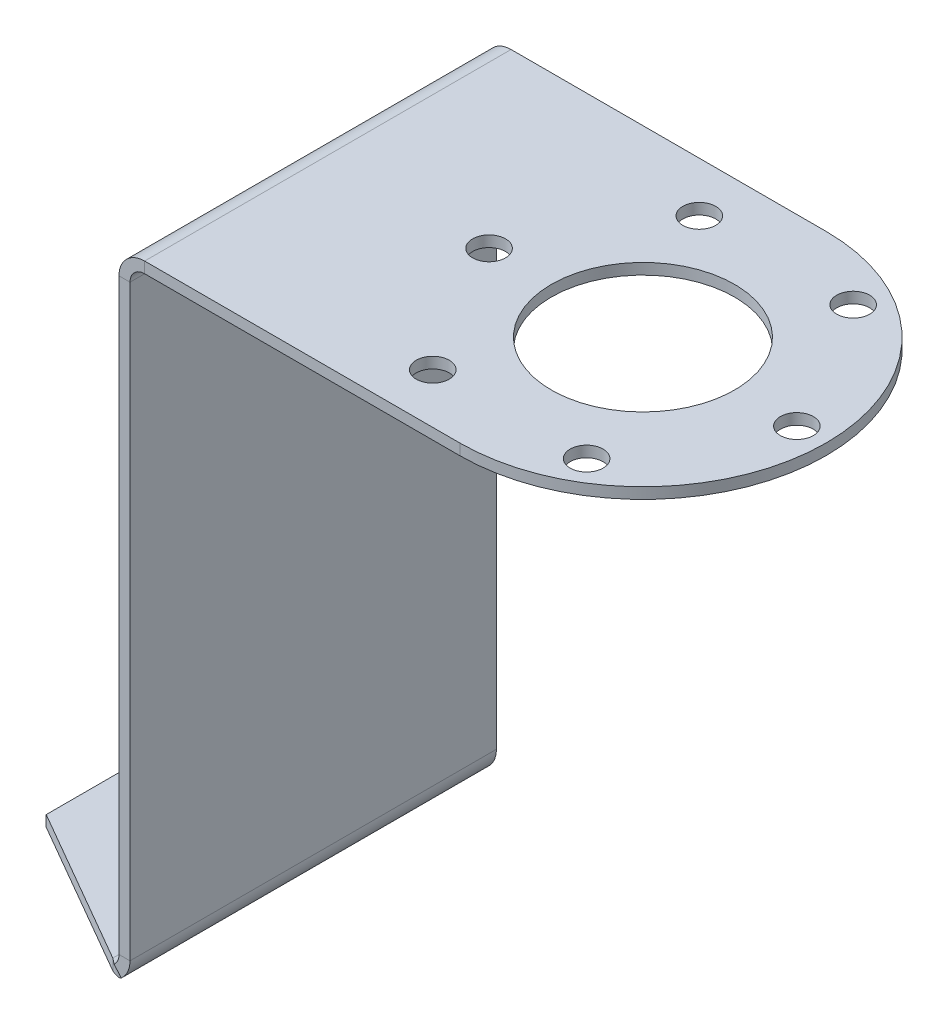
ISO-10303-21;
HEADER;
FILE_DESCRIPTION(('STEP AP214'),'2;1');
FILE_NAME('part.step','',(''),(''),'','','');
FILE_SCHEMA(('AUTOMOTIVE_DESIGN { 1 0 10303 214 1 1 1 1 }'));
ENDSEC;
DATA;
#1=APPLICATION_CONTEXT('core data for automotive mechanical design processes');
#2=APPLICATION_PROTOCOL_DEFINITION('international standard','automotive_design',2000,#1);
#3=PRODUCT_CONTEXT('',#1,'mechanical');
#4=PRODUCT('Part','Part','',(#3));
#5=PRODUCT_RELATED_PRODUCT_CATEGORY('part','',(#4));
#6=PRODUCT_DEFINITION_FORMATION('','',#4);
#7=PRODUCT_DEFINITION_CONTEXT('part definition',#1,'design');
#8=PRODUCT_DEFINITION('design','',#6,#7);
#9=PRODUCT_DEFINITION_SHAPE('','',#8);
#10=(LENGTH_UNIT() NAMED_UNIT(*) SI_UNIT(.MILLI.,.METRE.));
#11=(NAMED_UNIT(*) PLANE_ANGLE_UNIT() SI_UNIT($,.RADIAN.));
#12=(NAMED_UNIT(*) SI_UNIT($,.STERADIAN.) SOLID_ANGLE_UNIT());
#13=UNCERTAINTY_MEASURE_WITH_UNIT(LENGTH_MEASURE(1.E-05),#10,'distance_accuracy_value','');
#14=(GEOMETRIC_REPRESENTATION_CONTEXT(3) GLOBAL_UNCERTAINTY_ASSIGNED_CONTEXT((#13)) GLOBAL_UNIT_ASSIGNED_CONTEXT((#10,
#11,#12)) REPRESENTATION_CONTEXT('',''));
#15=CARTESIAN_POINT('',(0.,0.,0.));
#16=DIRECTION('',(0.,0.,1.));
#17=DIRECTION('',(1.,0.,0.));
#18=AXIS2_PLACEMENT_3D('',#15,#16,#17);
#19=CARTESIAN_POINT('',(-1.2490009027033E-13,0.,0.));
#20=DIRECTION('',(0.,1.,0.));
#21=DIRECTION('',(-1.,0.,0.));
#22=AXIS2_PLACEMENT_3D('',#19,#20,#21);
#23=CYLINDRICAL_SURFACE('',#22,12.5);
#24=CARTESIAN_POINT('',(-1.2490009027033E-13,0.,0.));
#25=DIRECTION('',(0.,1.,0.));
#26=DIRECTION('',(-1.,0.,0.));
#27=AXIS2_PLACEMENT_3D('',#24,#25,#26);
#28=CIRCLE('',#27,12.5);
#29=CARTESIAN_POINT('',(-12.5000000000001,0.,-1.13981649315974E-13));
#30=VERTEX_POINT('',#29);
#31=EDGE_CURVE('E479',#30,#30,#28,.T.);
#32=ORIENTED_EDGE('',*,*,#31,.F.);
#33=EDGE_LOOP('',(#32));
#34=FACE_BOUND('',#33,.T.);
#35=CARTESIAN_POINT('',(-1.2490009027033E-13,1.5000000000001,0.));
#36=DIRECTION('',(0.,1.,0.));
#37=DIRECTION('',(-1.,0.,0.));
#38=AXIS2_PLACEMENT_3D('',#35,#36,#37);
#39=CIRCLE('',#38,12.5);
#40=CARTESIAN_POINT('',(-12.5000000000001,1.5000000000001,-1.19810320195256E-13));
#41=VERTEX_POINT('',#40);
#42=EDGE_CURVE('E510',#41,#41,#39,.T.);
#43=ORIENTED_EDGE('',*,*,#42,.T.);
#44=EDGE_LOOP('',(#43));
#45=FACE_BOUND('',#44,.T.);
#46=ADVANCED_FACE('F28',(#34,#45),#23,.F.);
#47=CARTESIAN_POINT('',(-10.5000000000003,-85.7000000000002,18.1865334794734));
#48=DIRECTION('',(0.,1.,0.));
#49=DIRECTION('',(-1.,0.,0.));
#50=AXIS2_PLACEMENT_3D('',#47,#48,#49);
#51=CYLINDRICAL_SURFACE('',#50,2.25);
#52=CARTESIAN_POINT('',(-10.5000000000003,1.50000000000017,18.1865334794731));
#53=DIRECTION('',(0.,1.,0.));
#54=DIRECTION('',(-1.,0.,0.));
#55=AXIS2_PLACEMENT_3D('',#52,#53,#54);
#56=CIRCLE('',#55,2.25);
#57=CARTESIAN_POINT('',(-12.7500000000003,1.50000000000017,18.186533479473));
#58=VERTEX_POINT('',#57);
#59=EDGE_CURVE('E507',#58,#58,#56,.T.);
#60=ORIENTED_EDGE('',*,*,#59,.T.);
#61=EDGE_LOOP('',(#60));
#62=FACE_BOUND('',#61,.T.);
#63=CARTESIAN_POINT('',(-10.5000000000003,1.73472347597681E-13,18.1865334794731));
#64=DIRECTION('',(0.,1.,0.));
#65=DIRECTION('',(0.,0.,1.));
#66=AXIS2_PLACEMENT_3D('',#63,#64,#65);
#67=CIRCLE('',#66,2.25);
#68=CARTESIAN_POINT('',(-10.5000000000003,1.82215353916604E-13,20.4365334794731));
#69=VERTEX_POINT('',#68);
#70=EDGE_CURVE('E476',#69,#69,#67,.T.);
#71=ORIENTED_EDGE('',*,*,#70,.F.);
#72=EDGE_LOOP('',(#71));
#73=FACE_BOUND('',#72,.T.);
#74=ADVANCED_FACE('F650',(#62,#73),#51,.F.);
#75=CARTESIAN_POINT('',(10.4999999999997,-85.7000000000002,18.1865334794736));
#76=DIRECTION('',(0.,1.,0.));
#77=DIRECTION('',(-1.,0.,0.));
#78=AXIS2_PLACEMENT_3D('',#75,#76,#77);
#79=CYLINDRICAL_SURFACE('',#78,2.25);
#80=CARTESIAN_POINT('',(10.4999999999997,1.50000000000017,18.1865334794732));
#81=DIRECTION('',(0.,1.,0.));
#82=DIRECTION('',(-0.500000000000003,0.,0.866025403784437));
#83=AXIS2_PLACEMENT_3D('',#80,#81,#82);
#84=CIRCLE('',#83,2.25);
#85=CARTESIAN_POINT('',(9.37499999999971,1.50000000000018,20.1350906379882));
#86=VERTEX_POINT('',#85);
#87=EDGE_CURVE('E498',#86,#86,#84,.T.);
#88=ORIENTED_EDGE('',*,*,#87,.T.);
#89=EDGE_LOOP('',(#88));
#90=FACE_BOUND('',#89,.T.);
#91=CARTESIAN_POINT('',(10.4999999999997,1.73472347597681E-13,18.1865334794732));
#92=DIRECTION('',(0.,1.,0.));
#93=DIRECTION('',(0.,0.,1.));
#94=AXIS2_PLACEMENT_3D('',#91,#92,#93);
#95=CIRCLE('',#94,2.25);
#96=CARTESIAN_POINT('',(10.4999999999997,1.82215353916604E-13,20.4365334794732));
#97=VERTEX_POINT('',#96);
#98=EDGE_CURVE('E473',#97,#97,#95,.T.);
#99=ORIENTED_EDGE('',*,*,#98,.F.);
#100=EDGE_LOOP('',(#99));
#101=FACE_BOUND('',#100,.T.);
#102=ADVANCED_FACE('F646',(#90,#101),#79,.F.);
#103=CARTESIAN_POINT('',(20.9999999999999,-85.7000000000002,4.06726827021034E-13));
#104=DIRECTION('',(0.,1.,0.));
#105=DIRECTION('',(-1.,0.,0.));
#106=AXIS2_PLACEMENT_3D('',#103,#104,#105);
#107=CYLINDRICAL_SURFACE('',#106,2.25);
#108=CARTESIAN_POINT('',(20.9999999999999,1.50000000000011,0.));
#109=DIRECTION('',(0.,1.,0.));
#110=DIRECTION('',(0.499999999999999,0.,0.866025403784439));
#111=AXIS2_PLACEMENT_3D('',#108,#109,#110);
#112=CIRCLE('',#111,2.25);
#113=CARTESIAN_POINT('',(22.1249999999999,1.50000000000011,1.94855715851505));
#114=VERTEX_POINT('',#113);
#115=EDGE_CURVE('E495',#114,#114,#112,.T.);
#116=ORIENTED_EDGE('',*,*,#115,.T.);
#117=EDGE_LOOP('',(#116));
#118=FACE_BOUND('',#117,.T.);
#119=CARTESIAN_POINT('',(20.9999999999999,1.04083408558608E-13,0.));
#120=DIRECTION('',(0.,1.,0.));
#121=DIRECTION('',(0.,0.,1.));
#122=AXIS2_PLACEMENT_3D('',#119,#120,#121);
#123=CIRCLE('',#122,2.25);
#124=CARTESIAN_POINT('',(20.9999999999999,1.12826414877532E-13,2.25000000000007));
#125=VERTEX_POINT('',#124);
#126=EDGE_CURVE('E470',#125,#125,#123,.T.);
#127=ORIENTED_EDGE('',*,*,#126,.F.);
#128=EDGE_LOOP('',(#127));
#129=FACE_BOUND('',#128,.T.);
#130=ADVANCED_FACE('F642',(#118,#129),#107,.F.);
#131=CARTESIAN_POINT('',(10.4999999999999,-85.7000000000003,-18.1865334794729));
#132=DIRECTION('',(0.,1.,0.));
#133=DIRECTION('',(-1.,0.,0.));
#134=AXIS2_PLACEMENT_3D('',#131,#132,#133);
#135=CYLINDRICAL_SURFACE('',#134,2.25);
#136=CARTESIAN_POINT('',(10.4999999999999,1.50000000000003,-18.1865334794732));
#137=DIRECTION('',(0.,1.,0.));
#138=DIRECTION('',(1.,0.,0.));
#139=AXIS2_PLACEMENT_3D('',#136,#137,#138);
#140=CIRCLE('',#139,2.25);
#141=CARTESIAN_POINT('',(12.7499999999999,1.50000000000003,-18.1865334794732));
#142=VERTEX_POINT('',#141);
#143=EDGE_CURVE('E492',#142,#142,#140,.T.);
#144=ORIENTED_EDGE('',*,*,#143,.T.);
#145=EDGE_LOOP('',(#144));
#146=FACE_BOUND('',#145,.T.);
#147=CARTESIAN_POINT('',(10.4999999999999,0.,-18.1865334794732));
#148=DIRECTION('',(0.,1.,0.));
#149=DIRECTION('',(0.,0.,1.));
#150=AXIS2_PLACEMENT_3D('',#147,#148,#149);
#151=CIRCLE('',#150,2.25);
#152=CARTESIAN_POINT('',(10.4999999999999,0.,-15.9365334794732));
#153=VERTEX_POINT('',#152);
#154=EDGE_CURVE('E467',#153,#153,#151,.T.);
#155=ORIENTED_EDGE('',*,*,#154,.F.);
#156=EDGE_LOOP('',(#155));
#157=FACE_BOUND('',#156,.T.);
#158=ADVANCED_FACE('F638',(#146,#157),#135,.F.);
#159=CARTESIAN_POINT('',(-10.5000000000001,-85.7000000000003,-18.1865334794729));
#160=DIRECTION('',(0.,1.,0.));
#161=DIRECTION('',(-1.,0.,0.));
#162=AXIS2_PLACEMENT_3D('',#159,#160,#161);
#163=CYLINDRICAL_SURFACE('',#162,2.25);
#164=CARTESIAN_POINT('',(-10.5000000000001,1.50000000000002,-18.1865334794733));
#165=DIRECTION('',(0.,1.,0.));
#166=DIRECTION('',(0.499999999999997,0.,-0.86602540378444));
#167=AXIS2_PLACEMENT_3D('',#164,#165,#166);
#168=CIRCLE('',#167,2.25);
#169=CARTESIAN_POINT('',(-9.37500000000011,1.50000000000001,-20.1350906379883));
#170=VERTEX_POINT('',#169);
#171=EDGE_CURVE('E489',#170,#170,#168,.T.);
#172=ORIENTED_EDGE('',*,*,#171,.T.);
#173=EDGE_LOOP('',(#172));
#174=FACE_BOUND('',#173,.T.);
#175=CARTESIAN_POINT('',(-10.5000000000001,0.,-18.1865334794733));
#176=DIRECTION('',(0.,1.,0.));
#177=DIRECTION('',(0.,0.,1.));
#178=AXIS2_PLACEMENT_3D('',#175,#176,#177);
#179=CIRCLE('',#178,2.25);
#180=CARTESIAN_POINT('',(-10.5000000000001,0.,-15.9365334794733));
#181=VERTEX_POINT('',#180);
#182=EDGE_CURVE('E464',#181,#181,#179,.T.);
#183=ORIENTED_EDGE('',*,*,#182,.F.);
#184=EDGE_LOOP('',(#183));
#185=FACE_BOUND('',#184,.T.);
#186=ADVANCED_FACE('F635',(#174,#185),#163,.F.);
#187=CARTESIAN_POINT('',(-46.5000000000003,1.50000000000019,24.9999999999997));
#188=DIRECTION('',(0.,1.,0.));
#189=DIRECTION('',(-1.,0.,0.));
#190=AXIS2_PLACEMENT_3D('',#187,#188,#189);
#191=PLANE('',#190);
#192=DIRECTION('',(0.,0.,-1.));
#193=VECTOR('',#192,1.);
#194=CARTESIAN_POINT('',(-43.,1.49999999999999,-25.0000000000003));
#195=LINE('',#194,#193);
#196=CARTESIAN_POINT('',(-43.0000000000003,1.50000000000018,24.9999999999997));
#197=VERTEX_POINT('',#196);
#198=CARTESIAN_POINT('',(-43.,1.50000000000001,-25.0000000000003));
#199=VERTEX_POINT('',#198);
#200=EDGE_CURVE('E514',#197,#199,#195,.T.);
#201=ORIENTED_EDGE('',*,*,#200,.F.);
#202=DIRECTION('',(-1.,0.,0.));
#203=VECTOR('',#202,1.);
#204=CARTESIAN_POINT('',(-45.0000000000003,1.50000000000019,24.9999999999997));
#205=LINE('',#204,#203);
#206=CARTESIAN_POINT('',(-2.70616862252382E-13,1.5000000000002,25.));
#207=VERTEX_POINT('',#206);
#208=EDGE_CURVE('E11',#207,#197,#205,.T.);
#209=ORIENTED_EDGE('',*,*,#208,.F.);
#210=CARTESIAN_POINT('',(-1.2490009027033E-13,1.5000000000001,0.));
#211=DIRECTION('',(0.,-1.,0.));
#212=DIRECTION('',(1.,0.,0.));
#213=AXIS2_PLACEMENT_3D('',#210,#211,#212);
#214=CIRCLE('',#213,25.);
#215=CARTESIAN_POINT('',(0.,1.49999999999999,-25.0000000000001));
#216=VERTEX_POINT('',#215);
#217=EDGE_CURVE('E501',#216,#207,#214,.T.);
#218=ORIENTED_EDGE('',*,*,#217,.F.);
#219=DIRECTION('',(1.,0.,0.));
#220=VECTOR('',#219,1.);
#221=CARTESIAN_POINT('',(-46.5,1.50000000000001,-25.0000000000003));
#222=LINE('',#221,#220);
#223=EDGE_CURVE('E504',#199,#216,#222,.T.);
#224=ORIENTED_EDGE('',*,*,#223,.F.);
#225=EDGE_LOOP('',(#201,#209,#218,#224));
#226=FACE_BOUND('',#225,.T.);
#227=CARTESIAN_POINT('',(-21.0000000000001,1.5000000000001,0.));
#228=DIRECTION('',(0.,1.,0.));
#229=DIRECTION('',(-0.500000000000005,0.,-0.866025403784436));
#230=AXIS2_PLACEMENT_3D('',#227,#228,#229);
#231=CIRCLE('',#230,2.25);
#232=CARTESIAN_POINT('',(-22.1250000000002,1.50000000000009,-1.948557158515));
#233=VERTEX_POINT('',#232);
#234=EDGE_CURVE('E486',#233,#233,#231,.T.);
#235=ORIENTED_EDGE('',*,*,#234,.F.);
#236=EDGE_LOOP('',(#235));
#237=FACE_BOUND('',#236,.T.);
#238=ORIENTED_EDGE('',*,*,#171,.F.);
#239=EDGE_LOOP('',(#238));
#240=FACE_BOUND('',#239,.T.);
#241=ORIENTED_EDGE('',*,*,#143,.F.);
#242=EDGE_LOOP('',(#241));
#243=FACE_BOUND('',#242,.T.);
#244=ORIENTED_EDGE('',*,*,#115,.F.);
#245=EDGE_LOOP('',(#244));
#246=FACE_BOUND('',#245,.T.);
#247=ORIENTED_EDGE('',*,*,#87,.F.);
#248=EDGE_LOOP('',(#247));
#249=FACE_BOUND('',#248,.T.);
#250=ORIENTED_EDGE('',*,*,#59,.F.);
#251=EDGE_LOOP('',(#250));
#252=FACE_BOUND('',#251,.T.);
#253=ORIENTED_EDGE('',*,*,#42,.F.);
#254=EDGE_LOOP('',(#253));
#255=FACE_BOUND('',#254,.T.);
#256=ADVANCED_FACE('F533',(#226,#237,#240,#243,#246,#249,#252,#255),#191,.T.);
#257=CARTESIAN_POINT('',(-21.0000000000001,-85.7000000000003,3.17562040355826E-13));
#258=DIRECTION('',(0.,1.,0.));
#259=DIRECTION('',(-1.,0.,0.));
#260=AXIS2_PLACEMENT_3D('',#257,#258,#259);
#261=CYLINDRICAL_SURFACE('',#260,2.25);
#262=ORIENTED_EDGE('',*,*,#234,.T.);
#263=EDGE_LOOP('',(#262));
#264=FACE_BOUND('',#263,.T.);
#265=CARTESIAN_POINT('',(-21.0000000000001,0.,0.));
#266=DIRECTION('',(0.,1.,0.));
#267=DIRECTION('',(0.,0.,1.));
#268=AXIS2_PLACEMENT_3D('',#265,#266,#267);
#269=CIRCLE('',#268,2.25);
#270=CARTESIAN_POINT('',(-21.0000000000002,1.05887520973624E-13,2.24999999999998));
#271=VERTEX_POINT('',#270);
#272=EDGE_CURVE('E178',#271,#271,#269,.T.);
#273=ORIENTED_EDGE('',*,*,#272,.F.);
#274=EDGE_LOOP('',(#273));
#275=FACE_BOUND('',#274,.T.);
#276=ADVANCED_FACE('F620',(#264,#275),#261,.F.);
#277=CARTESIAN_POINT('',(-45.0000000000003,1.87350135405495E-13,24.9999999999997));
#278=DIRECTION('',(0.,1.,0.));
#279=DIRECTION('',(0.,0.,1.));
#280=AXIS2_PLACEMENT_3D('',#277,#278,#279);
#281=PLANE('',#280);
#282=ORIENTED_EDGE('',*,*,#272,.T.);
#283=EDGE_LOOP('',(#282));
#284=FACE_BOUND('',#283,.T.);
#285=ORIENTED_EDGE('',*,*,#182,.T.);
#286=EDGE_LOOP('',(#285));
#287=FACE_BOUND('',#286,.T.);
#288=ORIENTED_EDGE('',*,*,#154,.T.);
#289=EDGE_LOOP('',(#288));
#290=FACE_BOUND('',#289,.T.);
#291=ORIENTED_EDGE('',*,*,#126,.T.);
#292=EDGE_LOOP('',(#291));
#293=FACE_BOUND('',#292,.T.);
#294=ORIENTED_EDGE('',*,*,#98,.T.);
#295=EDGE_LOOP('',(#294));
#296=FACE_BOUND('',#295,.T.);
#297=ORIENTED_EDGE('',*,*,#70,.T.);
#298=EDGE_LOOP('',(#297));
#299=FACE_BOUND('',#298,.T.);
#300=ORIENTED_EDGE('',*,*,#31,.T.);
#301=EDGE_LOOP('',(#300));
#302=FACE_BOUND('',#301,.T.);
#303=DIRECTION('',(-1.,0.,0.));
#304=VECTOR('',#303,1.);
#305=CARTESIAN_POINT('',(-45.0000000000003,1.87350135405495E-13,24.9999999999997));
#306=LINE('',#305,#304);
#307=CARTESIAN_POINT('',(-2.70616862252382E-13,2.0122792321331E-13,25.));
#308=VERTEX_POINT('',#307);
#309=CARTESIAN_POINT('',(-43.0000000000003,1.83447007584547E-13,24.9999999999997));
#310=VERTEX_POINT('',#309);
#311=EDGE_CURVE('E36',#308,#310,#306,.T.);
#312=ORIENTED_EDGE('',*,*,#311,.T.);
#313=DIRECTION('',(0.,0.,-1.));
#314=VECTOR('',#313,1.);
#315=CARTESIAN_POINT('',(-43.,0.,-25.0000000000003));
#316=LINE('',#315,#314);
#317=CARTESIAN_POINT('',(-43.,0.,-25.0000000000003));
#318=VERTEX_POINT('',#317);
#319=EDGE_CURVE('E192',#310,#318,#316,.T.);
#320=ORIENTED_EDGE('',*,*,#319,.T.);
#321=DIRECTION('',(1.,0.,0.));
#322=VECTOR('',#321,1.);
#323=CARTESIAN_POINT('',(-45.,0.,-25.0000000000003));
#324=LINE('',#323,#322);
#325=CARTESIAN_POINT('',(0.,0.,-25.0000000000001));
#326=VERTEX_POINT('',#325);
#327=EDGE_CURVE('E482',#318,#326,#324,.T.);
#328=ORIENTED_EDGE('',*,*,#327,.T.);
#329=CARTESIAN_POINT('',(-1.2490009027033E-13,0.,0.));
#330=DIRECTION('',(0.,1.,0.));
#331=DIRECTION('',(0.,0.,1.));
#332=AXIS2_PLACEMENT_3D('',#329,#330,#331);
#333=CIRCLE('',#332,25.);
#334=EDGE_CURVE('E43',#326,#308,#333,.F.);
#335=ORIENTED_EDGE('',*,*,#334,.T.);
#336=EDGE_LOOP('',(#312,#320,#328,#335));
#337=FACE_BOUND('',#336,.T.);
#338=ADVANCED_FACE('F525',(#284,#287,#290,#293,#296,#299,#302,#337),#281,.F.);
#339=CARTESIAN_POINT('',(-45.,-168.807582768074,-24.9999999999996));
#340=DIRECTION('',(0.,0.,1.));
#341=DIRECTION('',(1.,0.,0.));
#342=AXIS2_PLACEMENT_3D('',#339,#340,#341);
#343=PLANE('',#342);
#344=ORIENTED_EDGE('',*,*,#223,.T.);
#345=DIRECTION('',(0.,1.,0.));
#346=VECTOR('',#345,1.);
#347=CARTESIAN_POINT('',(0.,-168.807582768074,-24.9999999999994));
#348=LINE('',#347,#346);
#349=EDGE_CURVE('E520',#326,#216,#348,.T.);
#350=ORIENTED_EDGE('',*,*,#349,.F.);
#351=ORIENTED_EDGE('',*,*,#327,.F.);
#352=DIRECTION('',(0.,1.,0.));
#353=VECTOR('',#352,1.);
#354=CARTESIAN_POINT('',(-43.,-168.807582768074,-24.9999999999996));
#355=LINE('',#354,#353);
#356=EDGE_CURVE('E522',#318,#199,#355,.T.);
#357=ORIENTED_EDGE('',*,*,#356,.T.);
#358=EDGE_LOOP('',(#344,#350,#351,#357));
#359=FACE_BOUND('',#358,.T.);
#360=ADVANCED_FACE('F30',(#359),#343,.F.);
#361=CARTESIAN_POINT('',(-1.31838984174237E-13,-168.807582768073,6.11356517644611E-13));
#362=DIRECTION('',(0.,1.,0.));
#363=DIRECTION('',(0.,0.,1.));
#364=AXIS2_PLACEMENT_3D('',#361,#362,#363);
#365=CYLINDRICAL_SURFACE('',#364,25.);
#366=ORIENTED_EDGE('',*,*,#217,.T.);
#367=DIRECTION('',(0.,1.,0.));
#368=VECTOR('',#367,1.);
#369=CARTESIAN_POINT('',(-2.77555756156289E-13,-168.807582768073,25.0000000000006));
#370=LINE('',#369,#368);
#371=EDGE_CURVE('E518',#308,#207,#370,.T.);
#372=ORIENTED_EDGE('',*,*,#371,.F.);
#373=ORIENTED_EDGE('',*,*,#334,.F.);
#374=ORIENTED_EDGE('',*,*,#349,.T.);
#375=EDGE_LOOP('',(#366,#372,#373,#374));
#376=FACE_BOUND('',#375,.T.);
#377=ADVANCED_FACE('F529',(#376),#365,.T.);
#378=CARTESIAN_POINT('',(-45.0000000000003,-168.807582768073,25.0000000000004));
#379=DIRECTION('',(0.,0.,1.));
#380=DIRECTION('',(1.,0.,0.));
#381=AXIS2_PLACEMENT_3D('',#378,#379,#380);
#382=PLANE('',#381);
#383=ORIENTED_EDGE('',*,*,#371,.T.);
#384=ORIENTED_EDGE('',*,*,#208,.T.);
#385=DIRECTION('',(0.,1.,0.));
#386=VECTOR('',#385,1.);
#387=CARTESIAN_POINT('',(-43.0000000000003,-168.807582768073,25.0000000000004));
#388=LINE('',#387,#386);
#389=EDGE_CURVE('E516',#310,#197,#388,.T.);
#390=ORIENTED_EDGE('',*,*,#389,.F.);
#391=ORIENTED_EDGE('',*,*,#311,.F.);
#392=EDGE_LOOP('',(#383,#384,#390,#391));
#393=FACE_BOUND('',#392,.T.);
#394=ADVANCED_FACE('F531',(#393),#382,.T.);
#395=CARTESIAN_POINT('',(-234.018940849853,-84.2,-25.0000000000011));
#396=DIRECTION('',(0.,0.,-1.));
#397=DIRECTION('',(0.,-1.,0.));
#398=AXIS2_PLACEMENT_3D('',#395,#396,#397);
#399=PLANE('',#398);
#400=DIRECTION('',(0.,1.,0.));
#401=VECTOR('',#400,1.);
#402=CARTESIAN_POINT('',(-45.,-85.7,-25.));
#403=LINE('',#402,#401);
#404=CARTESIAN_POINT('',(-45.,-82.2,-25.));
#405=VERTEX_POINT('',#404);
#406=CARTESIAN_POINT('',(-45.,-1.99999999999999,-25.0000000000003));
#407=VERTEX_POINT('',#406);
#408=EDGE_CURVE('E162',#405,#407,#403,.T.);
#409=ORIENTED_EDGE('',*,*,#408,.F.);
#410=DIRECTION('',(1.,0.,0.));
#411=VECTOR('',#410,1.);
#412=CARTESIAN_POINT('',(-234.018940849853,-82.2,-25.0000000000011));
#413=LINE('',#412,#411);
#414=CARTESIAN_POINT('',(-46.5,-82.2,-25.));
#415=VERTEX_POINT('',#414);
#416=EDGE_CURVE('E457',#415,#405,#413,.T.);
#417=ORIENTED_EDGE('',*,*,#416,.F.);
#418=DIRECTION('',(0.,1.,0.));
#419=VECTOR('',#418,1.);
#420=CARTESIAN_POINT('',(-46.5,-84.2,-25.));
#421=LINE('',#420,#419);
#422=CARTESIAN_POINT('',(-46.5,-1.99999999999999,-25.0000000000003));
#423=VERTEX_POINT('',#422);
#424=EDGE_CURVE('E168',#415,#423,#421,.T.);
#425=ORIENTED_EDGE('',*,*,#424,.T.);
#426=DIRECTION('',(1.,0.,0.));
#427=VECTOR('',#426,1.);
#428=CARTESIAN_POINT('',(-234.018940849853,-1.99999999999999,-25.0000000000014));
#429=LINE('',#428,#427);
#430=EDGE_CURVE('E459',#423,#407,#429,.T.);
#431=ORIENTED_EDGE('',*,*,#430,.T.);
#432=EDGE_LOOP('',(#409,#417,#425,#431));
#433=FACE_BOUND('',#432,.T.);
#434=ADVANCED_FACE('F542',(#433),#399,.T.);
#435=CARTESIAN_POINT('',(-234.018940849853,-84.1999999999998,24.9999999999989));
#436=DIRECTION('',(0.,0.,-1.));
#437=DIRECTION('',(0.,-1.,0.));
#438=AXIS2_PLACEMENT_3D('',#435,#436,#437);
#439=PLANE('',#438);
#440=DIRECTION('',(1.,0.,0.));
#441=VECTOR('',#440,1.);
#442=CARTESIAN_POINT('',(-234.018940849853,-82.2,24.9999999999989));
#443=LINE('',#442,#441);
#444=CARTESIAN_POINT('',(-46.5000000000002,-82.2,25.));
#445=VERTEX_POINT('',#444);
#446=CARTESIAN_POINT('',(-45.0000000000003,-82.2,25.));
#447=VERTEX_POINT('',#446);
#448=EDGE_CURVE('E177',#445,#447,#443,.T.);
#449=ORIENTED_EDGE('',*,*,#448,.T.);
#450=DIRECTION('',(0.,1.,0.));
#451=VECTOR('',#450,1.);
#452=CARTESIAN_POINT('',(-45.0000000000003,-84.1999999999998,25.));
#453=LINE('',#452,#451);
#454=CARTESIAN_POINT('',(-45.0000000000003,-1.99999999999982,24.9999999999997));
#455=VERTEX_POINT('',#454);
#456=EDGE_CURVE('E159',#447,#455,#453,.T.);
#457=ORIENTED_EDGE('',*,*,#456,.T.);
#458=DIRECTION('',(1.,0.,0.));
#459=VECTOR('',#458,1.);
#460=CARTESIAN_POINT('',(-234.018940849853,-1.99999999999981,24.9999999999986));
#461=LINE('',#460,#459);
#462=CARTESIAN_POINT('',(-46.5000000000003,-1.99999999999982,24.9999999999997));
#463=VERTEX_POINT('',#462);
#464=EDGE_CURVE('E175',#463,#455,#461,.T.);
#465=ORIENTED_EDGE('',*,*,#464,.F.);
#466=DIRECTION('',(0.,1.,0.));
#467=VECTOR('',#466,1.);
#468=CARTESIAN_POINT('',(-46.5000000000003,-84.1999999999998,25.));
#469=LINE('',#468,#467);
#470=EDGE_CURVE('E179',#445,#463,#469,.T.);
#471=ORIENTED_EDGE('',*,*,#470,.F.);
#472=EDGE_LOOP('',(#449,#457,#465,#471));
#473=FACE_BOUND('',#472,.T.);
#474=ADVANCED_FACE('F173',(#473),#439,.F.);
#475=CARTESIAN_POINT('',(-46.5000000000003,-84.1999999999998,25.));
#476=DIRECTION('',(-1.,0.,0.));
#477=DIRECTION('',(0.,0.,1.));
#478=AXIS2_PLACEMENT_3D('',#475,#476,#477);
#479=PLANE('',#478);
#480=DIRECTION('',(0.,0.,1.));
#481=VECTOR('',#480,1.);
#482=CARTESIAN_POINT('',(-46.5,-1.99999999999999,-25.0000000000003));
#483=LINE('',#482,#481);
#484=EDGE_CURVE('E188',#423,#463,#483,.T.);
#485=ORIENTED_EDGE('',*,*,#484,.F.);
#486=ORIENTED_EDGE('',*,*,#424,.F.);
#487=DIRECTION('',(0.,0.,-1.));
#488=VECTOR('',#487,1.);
#489=CARTESIAN_POINT('',(-46.5000000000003,-82.2,25.));
#490=LINE('',#489,#488);
#491=EDGE_CURVE('E452',#445,#415,#490,.T.);
#492=ORIENTED_EDGE('',*,*,#491,.F.);
#493=ORIENTED_EDGE('',*,*,#470,.T.);
#494=EDGE_LOOP('',(#485,#486,#492,#493));
#495=FACE_BOUND('',#494,.T.);
#496=ADVANCED_FACE('F548',(#495),#479,.T.);
#497=CARTESIAN_POINT('',(-45.0000000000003,-85.6999999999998,25.));
#498=DIRECTION('',(-1.,0.,0.));
#499=DIRECTION('',(0.,-1.,0.));
#500=AXIS2_PLACEMENT_3D('',#497,#498,#499);
#501=PLANE('',#500);
#502=ORIENTED_EDGE('',*,*,#408,.T.);
#503=DIRECTION('',(0.,0.,1.));
#504=VECTOR('',#503,1.);
#505=CARTESIAN_POINT('',(-45.,-1.99999999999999,-25.0000000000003));
#506=LINE('',#505,#504);
#507=EDGE_CURVE('E155',#407,#455,#506,.T.);
#508=ORIENTED_EDGE('',*,*,#507,.T.);
#509=ORIENTED_EDGE('',*,*,#456,.F.);
#510=DIRECTION('',(0.,0.,-1.));
#511=VECTOR('',#510,1.);
#512=CARTESIAN_POINT('',(-45.0000000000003,-82.2,25.));
#513=LINE('',#512,#511);
#514=EDGE_CURVE('E169',#447,#405,#513,.T.);
#515=ORIENTED_EDGE('',*,*,#514,.T.);
#516=EDGE_LOOP('',(#502,#508,#509,#515));
#517=FACE_BOUND('',#516,.T.);
#518=ADVANCED_FACE('F157',(#517),#501,.F.);
#519=CARTESIAN_POINT('',(-70.,-85.7,25.));
#520=DIRECTION('',(0.,1.,0.));
#521=DIRECTION('',(-1.,0.,0.));
#522=AXIS2_PLACEMENT_3D('',#519,#520,#521);
#523=PLANE('',#522);
#524=DIRECTION('',(-1.,0.,0.));
#525=VECTOR('',#524,1.);
#526=CARTESIAN_POINT('',(-57.5,-85.7000000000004,3.25));
#527=LINE('',#526,#525);
#528=CARTESIAN_POINT('',(-57.5,-85.7000000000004,3.25));
#529=VERTEX_POINT('',#528);
#530=CARTESIAN_POINT('',(-62.5,-85.7000000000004,3.25));
#531=VERTEX_POINT('',#530);
#532=EDGE_CURVE('E384',#529,#531,#527,.T.);
#533=ORIENTED_EDGE('',*,*,#532,.F.);
#534=CARTESIAN_POINT('',(-57.5,-85.7000000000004,0.));
#535=DIRECTION('',(0.,1.,0.));
#536=DIRECTION('',(0.,0.,1.));
#537=AXIS2_PLACEMENT_3D('',#534,#535,#536);
#538=CIRCLE('',#537,3.25);
#539=CARTESIAN_POINT('',(-57.5,-85.7000000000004,-3.25));
#540=VERTEX_POINT('',#539);
#541=EDGE_CURVE('E366',#529,#540,#538,.T.);
#542=ORIENTED_EDGE('',*,*,#541,.T.);
#543=DIRECTION('',(-1.,0.,0.));
#544=VECTOR('',#543,1.);
#545=CARTESIAN_POINT('',(-57.5,-85.7000000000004,-3.25));
#546=LINE('',#545,#544);
#547=CARTESIAN_POINT('',(-62.5,-85.7,-3.25));
#548=VERTEX_POINT('',#547);
#549=EDGE_CURVE('E375',#540,#548,#546,.T.);
#550=ORIENTED_EDGE('',*,*,#549,.T.);
#551=CARTESIAN_POINT('',(-62.5,-85.7000000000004,0.));
#552=DIRECTION('',(0.,1.,0.));
#553=DIRECTION('',(0.,0.,1.));
#554=AXIS2_PLACEMENT_3D('',#551,#552,#553);
#555=CIRCLE('',#554,3.25);
#556=EDGE_CURVE('E381',#548,#531,#555,.T.);
#557=ORIENTED_EDGE('',*,*,#556,.T.);
#558=EDGE_LOOP('',(#533,#542,#550,#557));
#559=FACE_BOUND('',#558,.T.);
#560=DIRECTION('',(0.,0.,-1.));
#561=VECTOR('',#560,1.);
#562=CARTESIAN_POINT('',(-48.5000000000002,-85.7,23.8452994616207));
#563=LINE('',#562,#561);
#564=CARTESIAN_POINT('',(-48.5000000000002,-85.7,23.8452994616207));
#565=VERTEX_POINT('',#564);
#566=CARTESIAN_POINT('',(-48.5,-85.7000000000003,-23.8452994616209));
#567=VERTEX_POINT('',#566);
#568=EDGE_CURVE('E397',#565,#567,#563,.T.);
#569=ORIENTED_EDGE('',*,*,#568,.F.);
#570=DIRECTION('',(-0.866025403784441,0.,-0.499999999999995));
#571=VECTOR('',#570,1.);
#572=CARTESIAN_POINT('',(-46.5000000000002,-85.7000000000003,25.));
#573=LINE('',#572,#571);
#574=CARTESIAN_POINT('',(-70.0000000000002,-85.7,11.432268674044));
#575=VERTEX_POINT('',#574);
#576=EDGE_CURVE('E392',#565,#575,#573,.T.);
#577=ORIENTED_EDGE('',*,*,#576,.T.);
#578=DIRECTION('',(0.,0.,-1.));
#579=VECTOR('',#578,1.);
#580=CARTESIAN_POINT('',(-70.,-85.7,25.));
#581=LINE('',#580,#579);
#582=CARTESIAN_POINT('',(-70.0000000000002,-85.7000000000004,-11.432268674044));
#583=VERTEX_POINT('',#582);
#584=EDGE_CURVE('E388',#575,#583,#581,.T.);
#585=ORIENTED_EDGE('',*,*,#584,.T.);
#586=DIRECTION('',(0.866025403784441,0.,-0.499999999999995));
#587=VECTOR('',#586,1.);
#588=CARTESIAN_POINT('',(-70.0000000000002,-85.7000000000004,-11.432268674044));
#589=LINE('',#588,#587);
#590=EDGE_CURVE('E387',#583,#567,#589,.T.);
#591=ORIENTED_EDGE('',*,*,#590,.T.);
#592=EDGE_LOOP('',(#569,#577,#585,#591));
#593=FACE_BOUND('',#592,.T.);
#594=ADVANCED_FACE('F595',(#559,#593),#523,.F.);
#595=CARTESIAN_POINT('',(-70.,-84.2,25.));
#596=DIRECTION('',(0.,1.,0.));
#597=DIRECTION('',(0.,0.,1.));
#598=AXIS2_PLACEMENT_3D('',#595,#596,#597);
#599=PLANE('',#598);
#600=CARTESIAN_POINT('',(-57.5,-84.2,0.));
#601=DIRECTION('',(0.,1.,0.));
#602=DIRECTION('',(0.,0.,1.));
#603=AXIS2_PLACEMENT_3D('',#600,#601,#602);
#604=CIRCLE('',#603,3.25);
#605=CARTESIAN_POINT('',(-57.5,-84.2,3.25));
#606=VERTEX_POINT('',#605);
#607=CARTESIAN_POINT('',(-57.5,-84.2,-3.25));
#608=VERTEX_POINT('',#607);
#609=EDGE_CURVE('E343',#606,#608,#604,.T.);
#610=ORIENTED_EDGE('',*,*,#609,.F.);
#611=DIRECTION('',(-1.,0.,0.));
#612=VECTOR('',#611,1.);
#613=CARTESIAN_POINT('',(-57.5,-84.2,3.25));
#614=LINE('',#613,#612);
#615=CARTESIAN_POINT('',(-62.5,-84.2,3.25));
#616=VERTEX_POINT('',#615);
#617=EDGE_CURVE('E350',#606,#616,#614,.T.);
#618=ORIENTED_EDGE('',*,*,#617,.T.);
#619=CARTESIAN_POINT('',(-62.5,-84.2,0.));
#620=DIRECTION('',(0.,1.,0.));
#621=DIRECTION('',(0.,0.,1.));
#622=AXIS2_PLACEMENT_3D('',#619,#620,#621);
#623=CIRCLE('',#622,3.25);
#624=CARTESIAN_POINT('',(-62.5,-84.2,-3.25));
#625=VERTEX_POINT('',#624);
#626=EDGE_CURVE('E352',#625,#616,#623,.T.);
#627=ORIENTED_EDGE('',*,*,#626,.F.);
#628=DIRECTION('',(-1.,0.,0.));
#629=VECTOR('',#628,1.);
#630=CARTESIAN_POINT('',(-57.5,-84.2,-3.25));
#631=LINE('',#630,#629);
#632=EDGE_CURVE('E355',#608,#625,#631,.T.);
#633=ORIENTED_EDGE('',*,*,#632,.F.);
#634=EDGE_LOOP('',(#610,#618,#627,#633));
#635=FACE_BOUND('',#634,.T.);
#636=DIRECTION('',(-0.866025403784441,0.,-0.499999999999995));
#637=VECTOR('',#636,1.);
#638=CARTESIAN_POINT('',(-46.5000000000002,-84.2000000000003,25.));
#639=LINE('',#638,#637);
#640=CARTESIAN_POINT('',(-48.5000000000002,-84.2,23.8452994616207));
#641=VERTEX_POINT('',#640);
#642=CARTESIAN_POINT('',(-70.0000000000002,-84.2000000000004,11.432268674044));
#643=VERTEX_POINT('',#642);
#644=EDGE_CURVE('E362',#641,#643,#639,.T.);
#645=ORIENTED_EDGE('',*,*,#644,.F.);
#646=DIRECTION('',(0.,0.,-1.));
#647=VECTOR('',#646,1.);
#648=CARTESIAN_POINT('',(-48.5000000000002,-84.2,23.8452994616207));
#649=LINE('',#648,#647);
#650=CARTESIAN_POINT('',(-48.5,-84.2,-23.8452994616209));
#651=VERTEX_POINT('',#650);
#652=EDGE_CURVE('E391',#641,#651,#649,.T.);
#653=ORIENTED_EDGE('',*,*,#652,.T.);
#654=DIRECTION('',(0.866025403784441,0.,-0.499999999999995));
#655=VECTOR('',#654,1.);
#656=CARTESIAN_POINT('',(-70.0000000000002,-84.2000000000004,-11.432268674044));
#657=LINE('',#656,#655);
#658=CARTESIAN_POINT('',(-70.0000000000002,-84.2,-11.432268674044));
#659=VERTEX_POINT('',#658);
#660=EDGE_CURVE('E358',#659,#651,#657,.T.);
#661=ORIENTED_EDGE('',*,*,#660,.F.);
#662=DIRECTION('',(0.,0.,-1.));
#663=VECTOR('',#662,1.);
#664=CARTESIAN_POINT('',(-70.,-84.2,25.));
#665=LINE('',#664,#663);
#666=EDGE_CURVE('E359',#643,#659,#665,.T.);
#667=ORIENTED_EDGE('',*,*,#666,.F.);
#668=EDGE_LOOP('',(#645,#653,#661,#667));
#669=FACE_BOUND('',#668,.T.);
#670=ADVANCED_FACE('F289',(#635,#669),#599,.T.);
#671=CARTESIAN_POINT('',(-57.5,-85.7000000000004,3.25));
#672=DIRECTION('',(0.,0.,-1.));
#673=DIRECTION('',(-1.,0.,0.));
#674=AXIS2_PLACEMENT_3D('',#671,#672,#673);
#675=PLANE('',#674);
#676=ORIENTED_EDGE('',*,*,#617,.F.);
#677=DIRECTION('',(0.,1.,0.));
#678=VECTOR('',#677,1.);
#679=CARTESIAN_POINT('',(-57.5,-85.7000000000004,3.25));
#680=LINE('',#679,#678);
#681=EDGE_CURVE('E369',#529,#606,#680,.T.);
#682=ORIENTED_EDGE('',*,*,#681,.F.);
#683=ORIENTED_EDGE('',*,*,#532,.T.);
#684=DIRECTION('',(0.,1.,0.));
#685=VECTOR('',#684,1.);
#686=CARTESIAN_POINT('',(-62.5,-85.7000000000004,3.25));
#687=LINE('',#686,#685);
#688=EDGE_CURVE('E378',#531,#616,#687,.T.);
#689=ORIENTED_EDGE('',*,*,#688,.T.);
#690=EDGE_LOOP('',(#676,#682,#683,#689));
#691=FACE_BOUND('',#690,.T.);
#692=ADVANCED_FACE('F432',(#691),#675,.T.);
#693=CARTESIAN_POINT('',(-62.5,-85.7000000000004,0.));
#694=DIRECTION('',(0.,1.,0.));
#695=DIRECTION('',(0.,0.,1.));
#696=AXIS2_PLACEMENT_3D('',#693,#694,#695);
#697=CYLINDRICAL_SURFACE('',#696,3.25);
#698=ORIENTED_EDGE('',*,*,#626,.T.);
#699=ORIENTED_EDGE('',*,*,#688,.F.);
#700=ORIENTED_EDGE('',*,*,#556,.F.);
#701=DIRECTION('',(0.,1.,0.));
#702=VECTOR('',#701,1.);
#703=CARTESIAN_POINT('',(-62.5,-85.7000000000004,-3.25));
#704=LINE('',#703,#702);
#705=EDGE_CURVE('E372',#548,#625,#704,.T.);
#706=ORIENTED_EDGE('',*,*,#705,.T.);
#707=EDGE_LOOP('',(#698,#699,#700,#706));
#708=FACE_BOUND('',#707,.T.);
#709=ADVANCED_FACE('F612',(#708),#697,.F.);
#710=CARTESIAN_POINT('',(-57.5,-85.7000000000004,-3.25));
#711=DIRECTION('',(0.,0.,-1.));
#712=DIRECTION('',(-1.,0.,0.));
#713=AXIS2_PLACEMENT_3D('',#710,#711,#712);
#714=PLANE('',#713);
#715=ORIENTED_EDGE('',*,*,#632,.T.);
#716=ORIENTED_EDGE('',*,*,#705,.F.);
#717=ORIENTED_EDGE('',*,*,#549,.F.);
#718=DIRECTION('',(0.,1.,0.));
#719=VECTOR('',#718,1.);
#720=CARTESIAN_POINT('',(-57.5,-85.7000000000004,-3.25));
#721=LINE('',#720,#719);
#722=EDGE_CURVE('E363',#540,#608,#721,.T.);
#723=ORIENTED_EDGE('',*,*,#722,.T.);
#724=EDGE_LOOP('',(#715,#716,#717,#723));
#725=FACE_BOUND('',#724,.T.);
#726=ADVANCED_FACE('F617',(#725),#714,.F.);
#727=CARTESIAN_POINT('',(-57.5,-85.7000000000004,0.));
#728=DIRECTION('',(0.,1.,0.));
#729=DIRECTION('',(0.,0.,1.));
#730=AXIS2_PLACEMENT_3D('',#727,#728,#729);
#731=CYLINDRICAL_SURFACE('',#730,3.25);
#732=ORIENTED_EDGE('',*,*,#609,.T.);
#733=ORIENTED_EDGE('',*,*,#722,.F.);
#734=ORIENTED_EDGE('',*,*,#541,.F.);
#735=ORIENTED_EDGE('',*,*,#681,.T.);
#736=EDGE_LOOP('',(#732,#733,#734,#735));
#737=FACE_BOUND('',#736,.T.);
#738=ADVANCED_FACE('F430',(#737),#731,.F.);
#739=CARTESIAN_POINT('',(-46.5000000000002,18.9258710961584,25.));
#740=DIRECTION('',(-0.499999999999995,0.,0.866025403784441));
#741=DIRECTION('',(0.866025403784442,0.,0.499999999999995));
#742=AXIS2_PLACEMENT_3D('',#739,#740,#741);
#743=PLANE('',#742);
#744=ORIENTED_EDGE('',*,*,#576,.F.);
#745=CARTESIAN_POINT('',(-48.5000000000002,-84.2,23.8452994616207));
#746=CARTESIAN_POINT('',(-48.5000000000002,-85.7,23.8452994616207));
#747=B_SPLINE_CURVE_WITH_KNOTS('',1,(#745,#746),.UNSPECIFIED.,.F.,.F.,(2,2),(0.,1.),.UNSPECIFIED.);
#748=EDGE_CURVE('E339',#641,#565,#747,.T.);
#749=ORIENTED_EDGE('',*,*,#748,.F.);
#750=ORIENTED_EDGE('',*,*,#644,.T.);
#751=DIRECTION('',(0.,-1.,0.));
#752=VECTOR('',#751,1.);
#753=CARTESIAN_POINT('',(-70.0000000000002,18.9258710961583,11.432268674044));
#754=LINE('',#753,#752);
#755=EDGE_CURVE('E393',#643,#575,#754,.T.);
#756=ORIENTED_EDGE('',*,*,#755,.T.);
#757=EDGE_LOOP('',(#744,#749,#750,#756));
#758=FACE_BOUND('',#757,.T.);
#759=ADVANCED_FACE('F425',(#758),#743,.T.);
#760=CARTESIAN_POINT('',(-70.0000000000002,18.9258710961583,-11.432268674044));
#761=DIRECTION('',(-0.499999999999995,0.,-0.866025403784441));
#762=DIRECTION('',(-0.866025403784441,0.,0.499999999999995));
#763=AXIS2_PLACEMENT_3D('',#760,#761,#762);
#764=PLANE('',#763);
#765=ORIENTED_EDGE('',*,*,#590,.F.);
#766=DIRECTION('',(0.,-1.,0.));
#767=VECTOR('',#766,1.);
#768=CARTESIAN_POINT('',(-70.0000000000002,18.9258710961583,-11.432268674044));
#769=LINE('',#768,#767);
#770=EDGE_CURVE('E396',#659,#583,#769,.T.);
#771=ORIENTED_EDGE('',*,*,#770,.F.);
#772=ORIENTED_EDGE('',*,*,#660,.T.);
#773=CARTESIAN_POINT('',(-48.5,-85.7,-23.8452994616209));
#774=CARTESIAN_POINT('',(-48.5,-84.2,-23.8452994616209));
#775=B_SPLINE_CURVE_WITH_KNOTS('',1,(#773,#774),.UNSPECIFIED.,.F.,.F.,(2,2),(0.,1.),.UNSPECIFIED.);
#776=EDGE_CURVE('E326',#651,#567,#775,.F.);
#777=ORIENTED_EDGE('',*,*,#776,.T.);
#778=EDGE_LOOP('',(#765,#771,#772,#777));
#779=FACE_BOUND('',#778,.T.);
#780=ADVANCED_FACE('F415',(#779),#764,.T.);
#781=CARTESIAN_POINT('',(-70.,18.9258710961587,25.));
#782=DIRECTION('',(-1.,0.,0.));
#783=DIRECTION('',(0.,0.,1.));
#784=AXIS2_PLACEMENT_3D('',#781,#782,#783);
#785=PLANE('',#784);
#786=ORIENTED_EDGE('',*,*,#584,.F.);
#787=ORIENTED_EDGE('',*,*,#755,.F.);
#788=ORIENTED_EDGE('',*,*,#666,.T.);
#789=ORIENTED_EDGE('',*,*,#770,.T.);
#790=EDGE_LOOP('',(#786,#787,#788,#789));
#791=FACE_BOUND('',#790,.T.);
#792=ADVANCED_FACE('F287',(#791),#785,.T.);
#793=CARTESIAN_POINT('',(-48.5,-85.7,-23.8452994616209));
#794=CARTESIAN_POINT('',(-48.0757108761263,-85.7,-24.0377707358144));
#795=CARTESIAN_POINT('',(-47.651638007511,-85.6220262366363,-24.2301996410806));
#796=CARTESIAN_POINT('',(-46.8586358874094,-85.3202412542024,-24.6150998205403));
#797=CARTESIAN_POINT('',(-46.4900178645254,-85.0965484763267,-24.8075287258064));
#798=CARTESIAN_POINT('',(-46.173077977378,-84.8144662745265,-25.));
#799=CARTESIAN_POINT('',(-48.5,-84.2,-23.8452994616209));
#800=CARTESIAN_POINT('',(-48.257556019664,-84.2,-24.0377652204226));
#801=CARTESIAN_POINT('',(-48.0152217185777,-84.1554435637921,-24.2301996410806));
#802=CARTESIAN_POINT('',(-47.5620776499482,-83.9829950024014,-24.6150998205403));
#803=CARTESIAN_POINT('',(-47.3514335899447,-83.8551659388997,-24.8075342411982));
#804=CARTESIAN_POINT('',(-47.1703302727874,-83.6939807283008,-25.));
#805=B_SPLINE_SURFACE_WITH_KNOTS('',1,3,((#793,#794,#795,#796,#797,#798),(#799,#800,#801,#802,
#803,#804)),.UNSPECIFIED.,.F.,.F.,.F.,(2,2),(4,2,4),(0.,1.),(0.,0.5,1.),.UNSPECIFIED.);
#806=CARTESIAN_POINT('',(-48.5,-84.2,-23.8452994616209));
#807=CARTESIAN_POINT('',(-48.257556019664,-84.2,-24.0377652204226));
#808=CARTESIAN_POINT('',(-48.0152217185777,-84.1554435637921,-24.2301996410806));
#809=CARTESIAN_POINT('',(-47.5620776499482,-83.9829950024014,-24.6150998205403));
#810=CARTESIAN_POINT('',(-47.3514335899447,-83.8551659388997,-24.8075342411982));
#811=CARTESIAN_POINT('',(-47.1703302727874,-83.6939807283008,-25.));
#812=B_SPLINE_CURVE_WITH_KNOTS('',3,(#806,#807,#808,#809,#810,#811),.UNSPECIFIED.,.F.,.F.,(4,2,
4),(0.,0.5,1.),.UNSPECIFIED.);
#813=CARTESIAN_POINT('',(-47.1703302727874,-83.6939807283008,-25.));
#814=VERTEX_POINT('',#813);
#815=EDGE_CURVE('E256',#651,#814,#812,.T.);
#816=CARTESIAN_POINT('',(-47.1703302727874,-83.6939807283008,-25.));
#817=CARTESIAN_POINT('',(-46.173077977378,-84.8144662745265,-25.));
#818=B_SPLINE_CURVE_WITH_KNOTS('',1,(#816,#817),.UNSPECIFIED.,.F.,.F.,(2,2),(0.,1.),.UNSPECIFIED.);
#819=CARTESIAN_POINT('',(-46.173077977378,-84.8144662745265,-25.));
#820=VERTEX_POINT('',#819);
#821=EDGE_CURVE('E317',#814,#820,#818,.T.);
#822=CARTESIAN_POINT('',(-46.173077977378,-84.8144662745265,-25.));
#823=CARTESIAN_POINT('',(-46.4900178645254,-85.0965484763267,-24.8075287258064));
#824=CARTESIAN_POINT('',(-46.8586358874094,-85.3202412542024,-24.6150998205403));
#825=CARTESIAN_POINT('',(-47.651638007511,-85.6220262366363,-24.2301996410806));
#826=CARTESIAN_POINT('',(-48.0757108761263,-85.7,-24.0377707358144));
#827=CARTESIAN_POINT('',(-48.5,-85.7,-23.8452994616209));
#828=B_SPLINE_CURVE_WITH_KNOTS('',3,(#822,#823,#824,#825,#826,#827),.UNSPECIFIED.,.F.,.F.,(4,2,
4),(0.,0.5,1.),.UNSPECIFIED.);
#829=EDGE_CURVE('E247',#567,#820,#828,.F.);
#830=ORIENTED_EDGE('',*,*,#776,.F.);
#831=ORIENTED_EDGE('',*,*,#815,.T.);
#832=ORIENTED_EDGE('',*,*,#821,.T.);
#833=ORIENTED_EDGE('',*,*,#829,.F.);
#834=EDGE_LOOP('',(#830,#831,#832,#833));
#835=FACE_BOUND('',#834,.T.);
#836=ADVANCED_FACE('F274',(#835),#805,.T.);
#837=CARTESIAN_POINT('',(-48.5,-82.2,-25.));
#838=DIRECTION('',(0.,0.,-1.));
#839=DIRECTION('',(0.,1.,0.));
#840=AXIS2_PLACEMENT_3D('',#837,#838,#839);
#841=PLANE('',#840);
#842=ORIENTED_EDGE('',*,*,#821,.F.);
#843=CARTESIAN_POINT('',(-48.5,-82.2,-25.));
#844=DIRECTION('',(0.,0.,-1.));
#845=DIRECTION('',(-1.,0.,0.));
#846=AXIS2_PLACEMENT_3D('',#843,#844,#845);
#847=CIRCLE('',#846,2.);
#848=EDGE_CURVE('E551',#814,#415,#847,.F.);
#849=ORIENTED_EDGE('',*,*,#848,.T.);
#850=ORIENTED_EDGE('',*,*,#416,.T.);
#851=CARTESIAN_POINT('',(-48.5,-82.2,-25.));
#852=DIRECTION('',(0.,0.,-1.));
#853=DIRECTION('',(-1.,0.,0.));
#854=AXIS2_PLACEMENT_3D('',#851,#852,#853);
#855=CIRCLE('',#854,3.5);
#856=EDGE_CURVE('E235',#820,#405,#855,.F.);
#857=ORIENTED_EDGE('',*,*,#856,.F.);
#858=EDGE_LOOP('',(#842,#849,#850,#857));
#859=FACE_BOUND('',#858,.T.);
#860=ADVANCED_FACE('F286',(#859),#841,.T.);
#861=CARTESIAN_POINT('',(-48.5000000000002,-82.2,25.));
#862=DIRECTION('',(0.,0.,1.));
#863=DIRECTION('',(0.,-1.,0.));
#864=AXIS2_PLACEMENT_3D('',#861,#862,#863);
#865=PLANE('',#864);
#866=ORIENTED_EDGE('',*,*,#448,.F.);
#867=CARTESIAN_POINT('',(-48.5000000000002,-82.2,25.));
#868=DIRECTION('',(0.,0.,-1.));
#869=DIRECTION('',(-1.,0.,0.));
#870=AXIS2_PLACEMENT_3D('',#867,#868,#869);
#871=CIRCLE('',#870,2.);
#872=CARTESIAN_POINT('',(-47.1703302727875,-83.6939807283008,25.));
#873=VERTEX_POINT('',#872);
#874=EDGE_CURVE('E553',#445,#873,#871,.T.);
#875=ORIENTED_EDGE('',*,*,#874,.T.);
#876=CARTESIAN_POINT('',(-46.1730779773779,-84.8144662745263,25.));
#877=CARTESIAN_POINT('',(-47.1703302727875,-83.6939807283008,25.));
#878=B_SPLINE_CURVE_WITH_KNOTS('',1,(#876,#877),.UNSPECIFIED.,.F.,.F.,(2,2),(0.,1.),.UNSPECIFIED.);
#879=CARTESIAN_POINT('',(-46.1730779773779,-84.8144662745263,25.));
#880=VERTEX_POINT('',#879);
#881=EDGE_CURVE('E786',#873,#880,#878,.F.);
#882=ORIENTED_EDGE('',*,*,#881,.T.);
#883=CARTESIAN_POINT('',(-48.5000000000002,-82.2,25.));
#884=DIRECTION('',(0.,0.,-1.));
#885=DIRECTION('',(-1.,0.,0.));
#886=AXIS2_PLACEMENT_3D('',#883,#884,#885);
#887=CIRCLE('',#886,3.5);
#888=EDGE_CURVE('E587',#447,#880,#887,.T.);
#889=ORIENTED_EDGE('',*,*,#888,.F.);
#890=EDGE_LOOP('',(#866,#875,#882,#889));
#891=FACE_BOUND('',#890,.T.);
#892=ADVANCED_FACE('F742',(#891),#865,.T.);
#893=CARTESIAN_POINT('',(-46.1730779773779,-84.8144662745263,25.));
#894=CARTESIAN_POINT('',(-46.4900178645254,-85.0965484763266,24.8075287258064));
#895=CARTESIAN_POINT('',(-46.8586358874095,-85.3202412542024,24.6150998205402));
#896=CARTESIAN_POINT('',(-47.6516380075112,-85.6220262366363,24.2301996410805));
#897=CARTESIAN_POINT('',(-48.0757108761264,-85.7,24.0377707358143));
#898=CARTESIAN_POINT('',(-48.5000000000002,-85.7,23.8452994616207));
#899=CARTESIAN_POINT('',(-47.1703302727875,-83.6939807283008,25.));
#900=CARTESIAN_POINT('',(-47.3514335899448,-83.8551659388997,24.8075342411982));
#901=CARTESIAN_POINT('',(-47.5620776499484,-83.9829950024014,24.6150998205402));
#902=CARTESIAN_POINT('',(-48.0152217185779,-84.1554435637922,24.2301996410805));
#903=CARTESIAN_POINT('',(-48.2575560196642,-84.2,24.0377652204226));
#904=CARTESIAN_POINT('',(-48.5000000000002,-84.2,23.8452994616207));
#905=B_SPLINE_SURFACE_WITH_KNOTS('',1,3,((#893,#894,#895,#896,#897,#898),(#899,#900,#901,#902,
#903,#904)),.UNSPECIFIED.,.F.,.F.,.F.,(2,2),(4,2,4),(0.,1.),(0.,0.5,1.),.UNSPECIFIED.);
#906=CARTESIAN_POINT('',(-47.1703302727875,-83.6939807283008,25.));
#907=CARTESIAN_POINT('',(-47.3514335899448,-83.8551659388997,24.8075342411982));
#908=CARTESIAN_POINT('',(-47.5620776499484,-83.9829950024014,24.6150998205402));
#909=CARTESIAN_POINT('',(-48.0152217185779,-84.1554435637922,24.2301996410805));
#910=CARTESIAN_POINT('',(-48.2575560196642,-84.2,24.0377652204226));
#911=CARTESIAN_POINT('',(-48.5000000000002,-84.2,23.8452994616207));
#912=B_SPLINE_CURVE_WITH_KNOTS('',3,(#906,#907,#908,#909,#910,#911),.UNSPECIFIED.,.F.,.F.,(4,2,
4),(0.,0.5,1.),.UNSPECIFIED.);
#913=EDGE_CURVE('E201',#873,#641,#912,.T.);
#914=CARTESIAN_POINT('',(-48.5000000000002,-85.7,23.8452994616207));
#915=CARTESIAN_POINT('',(-48.0757108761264,-85.7,24.0377707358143));
#916=CARTESIAN_POINT('',(-47.6516380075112,-85.6220262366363,24.2301996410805));
#917=CARTESIAN_POINT('',(-46.8586358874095,-85.3202412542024,24.6150998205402));
#918=CARTESIAN_POINT('',(-46.4900178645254,-85.0965484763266,24.8075287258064));
#919=CARTESIAN_POINT('',(-46.1730779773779,-84.8144662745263,25.));
#920=B_SPLINE_CURVE_WITH_KNOTS('',3,(#914,#915,#916,#917,#918,#919),.UNSPECIFIED.,.F.,.F.,(4,2,
4),(0.,0.5,1.),.UNSPECIFIED.);
#921=EDGE_CURVE('E554',#880,#565,#920,.F.);
#922=ORIENTED_EDGE('',*,*,#881,.F.);
#923=ORIENTED_EDGE('',*,*,#913,.T.);
#924=ORIENTED_EDGE('',*,*,#748,.T.);
#925=ORIENTED_EDGE('',*,*,#921,.F.);
#926=EDGE_LOOP('',(#922,#923,#924,#925));
#927=FACE_BOUND('',#926,.T.);
#928=ADVANCED_FACE('F219',(#927),#905,.T.);
#929=CARTESIAN_POINT('',(-48.5000000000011,-82.2000000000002,210.221986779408));
#930=DIRECTION('',(0.,0.,-1.));
#931=DIRECTION('',(-1.,0.,0.));
#932=AXIS2_PLACEMENT_3D('',#929,#930,#931);
#933=CYLINDRICAL_SURFACE('',#932,3.5);
#934=ORIENTED_EDGE('',*,*,#921,.T.);
#935=ORIENTED_EDGE('',*,*,#568,.T.);
#936=ORIENTED_EDGE('',*,*,#829,.T.);
#937=ORIENTED_EDGE('',*,*,#856,.T.);
#938=ORIENTED_EDGE('',*,*,#514,.F.);
#939=ORIENTED_EDGE('',*,*,#888,.T.);
#940=EDGE_LOOP('',(#934,#935,#936,#937,#938,#939));
#941=FACE_BOUND('',#940,.T.);
#942=ADVANCED_FACE('F208',(#941),#933,.T.);
#943=CARTESIAN_POINT('',(-48.5000000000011,-82.2000000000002,210.221986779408));
#944=DIRECTION('',(0.,0.,-1.));
#945=DIRECTION('',(-1.,0.,0.));
#946=AXIS2_PLACEMENT_3D('',#943,#944,#945);
#947=CYLINDRICAL_SURFACE('',#946,2.);
#948=ORIENTED_EDGE('',*,*,#913,.F.);
#949=ORIENTED_EDGE('',*,*,#874,.F.);
#950=ORIENTED_EDGE('',*,*,#491,.T.);
#951=ORIENTED_EDGE('',*,*,#848,.F.);
#952=ORIENTED_EDGE('',*,*,#815,.F.);
#953=ORIENTED_EDGE('',*,*,#652,.F.);
#954=EDGE_LOOP('',(#948,#949,#950,#951,#952,#953));
#955=FACE_BOUND('',#954,.T.);
#956=ADVANCED_FACE('F218',(#955),#947,.F.);
#957=CARTESIAN_POINT('',(-43.,-1.99999999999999,-25.0000000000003));
#958=DIRECTION('',(0.,0.,1.));
#959=DIRECTION('',(1.,0.,0.));
#960=AXIS2_PLACEMENT_3D('',#957,#958,#959);
#961=PLANE('',#960);
#962=ORIENTED_EDGE('',*,*,#356,.F.);
#963=CARTESIAN_POINT('',(-43.,-1.99999999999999,-25.0000000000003));
#964=DIRECTION('',(0.,0.,1.));
#965=DIRECTION('',(1.,0.,0.));
#966=AXIS2_PLACEMENT_3D('',#963,#964,#965);
#967=CIRCLE('',#966,2.);
#968=EDGE_CURVE('E193',#407,#318,#967,.F.);
#969=ORIENTED_EDGE('',*,*,#968,.F.);
#970=ORIENTED_EDGE('',*,*,#430,.F.);
#971=CARTESIAN_POINT('',(-43.,-1.99999999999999,-25.0000000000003));
#972=DIRECTION('',(0.,0.,1.));
#973=DIRECTION('',(1.,0.,0.));
#974=AXIS2_PLACEMENT_3D('',#971,#972,#973);
#975=CIRCLE('',#974,3.5);
#976=EDGE_CURVE('E198',#423,#199,#975,.F.);
#977=ORIENTED_EDGE('',*,*,#976,.T.);
#978=EDGE_LOOP('',(#962,#969,#970,#977));
#979=FACE_BOUND('',#978,.T.);
#980=ADVANCED_FACE('F540',(#979),#961,.F.);
#981=CARTESIAN_POINT('',(-43.0000000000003,-1.99999999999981,24.9999999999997));
#982=DIRECTION('',(0.,0.,-1.));
#983=DIRECTION('',(-1.,0.,0.));
#984=AXIS2_PLACEMENT_3D('',#981,#982,#983);
#985=PLANE('',#984);
#986=ORIENTED_EDGE('',*,*,#464,.T.);
#987=CARTESIAN_POINT('',(-43.0000000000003,-1.99999999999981,24.9999999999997));
#988=DIRECTION('',(0.,0.,1.));
#989=DIRECTION('',(1.,0.,0.));
#990=AXIS2_PLACEMENT_3D('',#987,#988,#989);
#991=CIRCLE('',#990,2.);
#992=EDGE_CURVE('E184',#310,#455,#991,.T.);
#993=ORIENTED_EDGE('',*,*,#992,.F.);
#994=ORIENTED_EDGE('',*,*,#389,.T.);
#995=CARTESIAN_POINT('',(-43.0000000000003,-1.99999999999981,24.9999999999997));
#996=DIRECTION('',(0.,0.,1.));
#997=DIRECTION('',(1.,0.,0.));
#998=AXIS2_PLACEMENT_3D('',#995,#996,#997);
#999=CIRCLE('',#998,3.5);
#1000=EDGE_CURVE('E187',#197,#463,#999,.T.);
#1001=ORIENTED_EDGE('',*,*,#1000,.T.);
#1002=EDGE_LOOP('',(#986,#993,#994,#1001));
#1003=FACE_BOUND('',#1002,.T.);
#1004=ADVANCED_FACE('F183',(#1003),#985,.F.);
#1005=CARTESIAN_POINT('',(-42.9999999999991,-2.00000000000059,-190.737983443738));
#1006=DIRECTION('',(0.,0.,1.));
#1007=DIRECTION('',(1.,0.,0.));
#1008=AXIS2_PLACEMENT_3D('',#1005,#1006,#1007);
#1009=CYLINDRICAL_SURFACE('',#1008,3.5);
#1010=ORIENTED_EDGE('',*,*,#1000,.F.);
#1011=ORIENTED_EDGE('',*,*,#200,.T.);
#1012=ORIENTED_EDGE('',*,*,#976,.F.);
#1013=ORIENTED_EDGE('',*,*,#484,.T.);
#1014=EDGE_LOOP('',(#1010,#1011,#1012,#1013));
#1015=FACE_BOUND('',#1014,.T.);
#1016=ADVANCED_FACE('F537',(#1015),#1009,.T.);
#1017=CARTESIAN_POINT('',(-42.9999999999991,-2.00000000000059,-190.737983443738));
#1018=DIRECTION('',(0.,0.,1.));
#1019=DIRECTION('',(1.,0.,0.));
#1020=AXIS2_PLACEMENT_3D('',#1017,#1018,#1019);
#1021=CYLINDRICAL_SURFACE('',#1020,2.);
#1022=ORIENTED_EDGE('',*,*,#992,.T.);
#1023=ORIENTED_EDGE('',*,*,#507,.F.);
#1024=ORIENTED_EDGE('',*,*,#968,.T.);
#1025=ORIENTED_EDGE('',*,*,#319,.F.);
#1026=EDGE_LOOP('',(#1022,#1023,#1024,#1025));
#1027=FACE_BOUND('',#1026,.T.);
#1028=ADVANCED_FACE('F190',(#1027),#1021,.F.);
#1029=CLOSED_SHELL('',(#46,#74,#102,#130,#158,#186,#256,#276,#338,#360,#377,#394,#434,#474,#496,
#518,#594,#670,#692,#709,#726,#738,#759,#780,#792,#836,#860,#892,#928,#942,#956,#980,#1004,
#1016,#1028));
#1030=MANIFOLD_SOLID_BREP('B2',#1029);
#1031=ADVANCED_BREP_SHAPE_REPRESENTATION('',(#18,#1030),#14);
#1032=SHAPE_DEFINITION_REPRESENTATION(#9,#1031);
ENDSEC;
END-ISO-10303-21;
